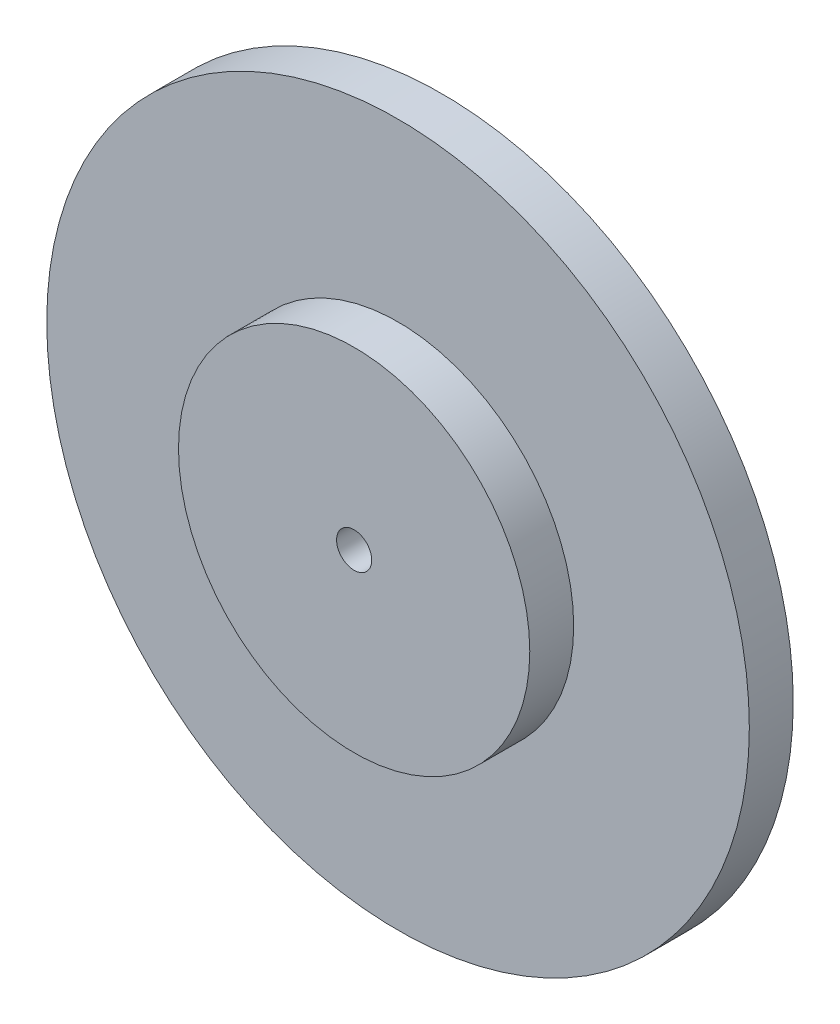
from build123d import *

# Parameters (mm, degrees)
SKETCH1_R           = 50.8
BOSS_EXTRUDE1_DEPTH = 6.35
SKETCH2_R           = 25.4
BOSS_EXTRUDE2_DEPTH = 6.35
SKETCH3_R           = 2.54
CUT_EXTRUDE1_DEPTH  = 73.955945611


with BuildPart() as part:
    # Sketch1 → Boss-Extrude1 (new body)
    with BuildSketch(Plane.XY):
        Circle(SKETCH1_R)
    extrude(amount=BOSS_EXTRUDE1_DEPTH)

    # Sketch2 → Boss-Extrude2 (add)
    with BuildSketch(Plane.XY.offset(6.35)):
        Circle(SKETCH2_R)
    extrude(amount=BOSS_EXTRUDE2_DEPTH)

    # Sketch3 → Cut-Extrude1 (cut, through all)
    with BuildSketch(Plane.XY.offset(12.7)):
        Circle(SKETCH3_R)
    extrude(amount=-CUT_EXTRUDE1_DEPTH, mode=Mode.SUBTRACT)


solid = part.part
